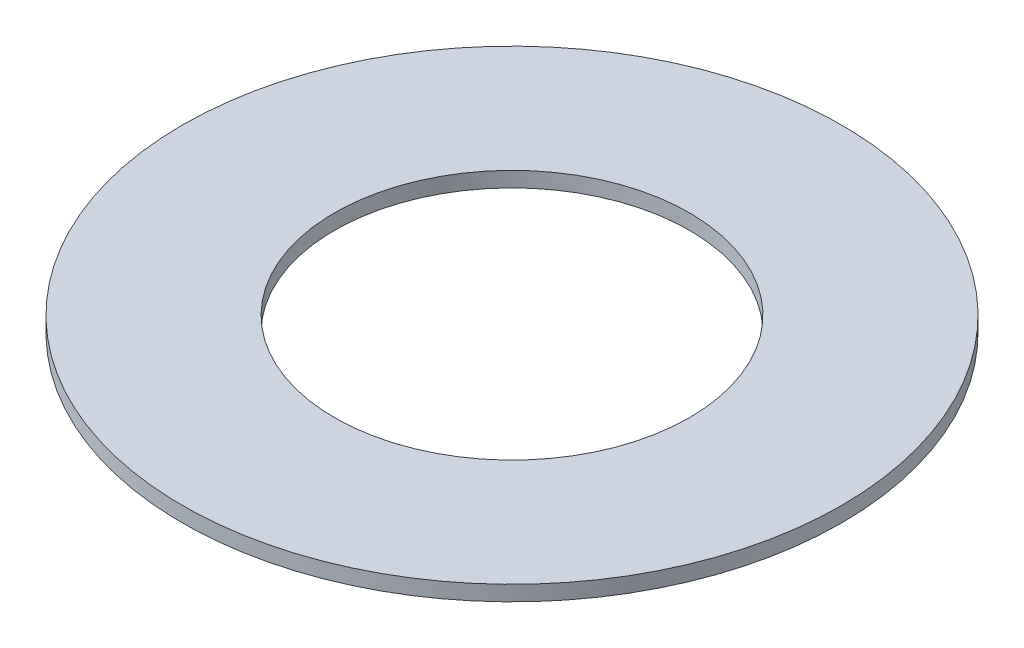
ISO-10303-21;
HEADER;
FILE_DESCRIPTION(('STEP AP214'),'2;1');
FILE_NAME('part.step','',(''),(''),'','','');
FILE_SCHEMA(('AUTOMOTIVE_DESIGN { 1 0 10303 214 1 1 1 1 }'));
ENDSEC;
DATA;
#1=APPLICATION_CONTEXT('core data for automotive mechanical design processes');
#2=APPLICATION_PROTOCOL_DEFINITION('international standard','automotive_design',2000,#1);
#3=PRODUCT_CONTEXT('',#1,'mechanical');
#4=PRODUCT('Part','Part','',(#3));
#5=PRODUCT_RELATED_PRODUCT_CATEGORY('part','',(#4));
#6=PRODUCT_DEFINITION_FORMATION('','',#4);
#7=PRODUCT_DEFINITION_CONTEXT('part definition',#1,'design');
#8=PRODUCT_DEFINITION('design','',#6,#7);
#9=PRODUCT_DEFINITION_SHAPE('','',#8);
#10=(LENGTH_UNIT() NAMED_UNIT(*) SI_UNIT(.MILLI.,.METRE.));
#11=(NAMED_UNIT(*) PLANE_ANGLE_UNIT() SI_UNIT($,.RADIAN.));
#12=(NAMED_UNIT(*) SI_UNIT($,.STERADIAN.) SOLID_ANGLE_UNIT());
#13=UNCERTAINTY_MEASURE_WITH_UNIT(LENGTH_MEASURE(1.E-05),#10,'distance_accuracy_value','');
#14=(GEOMETRIC_REPRESENTATION_CONTEXT(3) GLOBAL_UNCERTAINTY_ASSIGNED_CONTEXT((#13)) GLOBAL_UNIT_ASSIGNED_CONTEXT((#10,
#11,#12)) REPRESENTATION_CONTEXT('',''));
#15=CARTESIAN_POINT('',(0.,0.,0.));
#16=DIRECTION('',(0.,0.,1.));
#17=DIRECTION('',(1.,0.,0.));
#18=AXIS2_PLACEMENT_3D('',#15,#16,#17);
#19=CARTESIAN_POINT('',(0.,0.300000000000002,0.));
#20=DIRECTION('',(0.,-1.,0.));
#21=DIRECTION('',(1.,0.,0.));
#22=AXIS2_PLACEMENT_3D('',#19,#20,#21);
#23=PLANE('',#22);
#24=CARTESIAN_POINT('',(0.,0.300000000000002,0.));
#25=DIRECTION('',(0.,-1.,0.));
#26=DIRECTION('',(1.,0.,0.));
#27=AXIS2_PLACEMENT_3D('',#24,#25,#26);
#28=CIRCLE('',#27,6.5);
#29=CARTESIAN_POINT('',(6.5,0.300000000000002,0.));
#30=VERTEX_POINT('',#29);
#31=EDGE_CURVE('E26',#30,#30,#28,.T.);
#32=ORIENTED_EDGE('',*,*,#31,.F.);
#33=EDGE_LOOP('',(#32));
#34=FACE_BOUND('',#33,.T.);
#35=CARTESIAN_POINT('',(0.,0.300000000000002,0.));
#36=DIRECTION('',(0.,-1.,0.));
#37=DIRECTION('',(1.,0.,0.));
#38=AXIS2_PLACEMENT_3D('',#35,#36,#37);
#39=CIRCLE('',#38,3.5);
#40=CARTESIAN_POINT('',(3.5,0.300000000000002,0.));
#41=VERTEX_POINT('',#40);
#42=EDGE_CURVE('E17',#41,#41,#39,.T.);
#43=ORIENTED_EDGE('',*,*,#42,.T.);
#44=EDGE_LOOP('',(#43));
#45=FACE_BOUND('',#44,.T.);
#46=ADVANCED_FACE('F14',(#34,#45),#23,.F.);
#47=CARTESIAN_POINT('',(0.,0.315000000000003,0.));
#48=DIRECTION('',(0.,-1.,0.));
#49=DIRECTION('',(1.,0.,0.));
#50=AXIS2_PLACEMENT_3D('',#47,#48,#49);
#51=CYLINDRICAL_SURFACE('',#50,3.5);
#52=ORIENTED_EDGE('',*,*,#42,.F.);
#53=EDGE_LOOP('',(#52));
#54=FACE_BOUND('',#53,.T.);
#55=CARTESIAN_POINT('',(0.,0.,0.));
#56=DIRECTION('',(0.,-1.,0.));
#57=DIRECTION('',(1.,0.,0.));
#58=AXIS2_PLACEMENT_3D('',#55,#56,#57);
#59=CIRCLE('',#58,3.5);
#60=CARTESIAN_POINT('',(3.5,0.,0.));
#61=VERTEX_POINT('',#60);
#62=EDGE_CURVE('E21',#61,#61,#59,.F.);
#63=ORIENTED_EDGE('',*,*,#62,.F.);
#64=EDGE_LOOP('',(#63));
#65=FACE_BOUND('',#64,.T.);
#66=ADVANCED_FACE('F35',(#54,#65),#51,.F.);
#67=CARTESIAN_POINT('',(0.,0.315000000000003,0.));
#68=DIRECTION('',(0.,-1.,0.));
#69=DIRECTION('',(1.,0.,0.));
#70=AXIS2_PLACEMENT_3D('',#67,#68,#69);
#71=CYLINDRICAL_SURFACE('',#70,6.5);
#72=ORIENTED_EDGE('',*,*,#31,.T.);
#73=EDGE_LOOP('',(#72));
#74=FACE_BOUND('',#73,.T.);
#75=CARTESIAN_POINT('',(0.,0.,0.));
#76=DIRECTION('',(0.,-1.,0.));
#77=DIRECTION('',(1.,0.,0.));
#78=AXIS2_PLACEMENT_3D('',#75,#76,#77);
#79=CIRCLE('',#78,6.5);
#80=CARTESIAN_POINT('',(6.5,0.,0.));
#81=VERTEX_POINT('',#80);
#82=EDGE_CURVE('E10',#81,#81,#79,.T.);
#83=ORIENTED_EDGE('',*,*,#82,.F.);
#84=EDGE_LOOP('',(#83));
#85=FACE_BOUND('',#84,.T.);
#86=ADVANCED_FACE('F38',(#74,#85),#71,.T.);
#87=CARTESIAN_POINT('',(0.,0.,0.));
#88=DIRECTION('',(0.,-1.,0.));
#89=DIRECTION('',(1.,0.,0.));
#90=AXIS2_PLACEMENT_3D('',#87,#88,#89);
#91=PLANE('',#90);
#92=ORIENTED_EDGE('',*,*,#82,.T.);
#93=EDGE_LOOP('',(#92));
#94=FACE_BOUND('',#93,.T.);
#95=ORIENTED_EDGE('',*,*,#62,.T.);
#96=EDGE_LOOP('',(#95));
#97=FACE_BOUND('',#96,.T.);
#98=ADVANCED_FACE('F41',(#94,#97),#91,.T.);
#99=CLOSED_SHELL('',(#46,#66,#86,#98));
#100=MANIFOLD_SOLID_BREP('B1',#99);
#101=ADVANCED_BREP_SHAPE_REPRESENTATION('',(#18,#100),#14);
#102=SHAPE_DEFINITION_REPRESENTATION(#9,#101);
ENDSEC;
END-ISO-10303-21;
